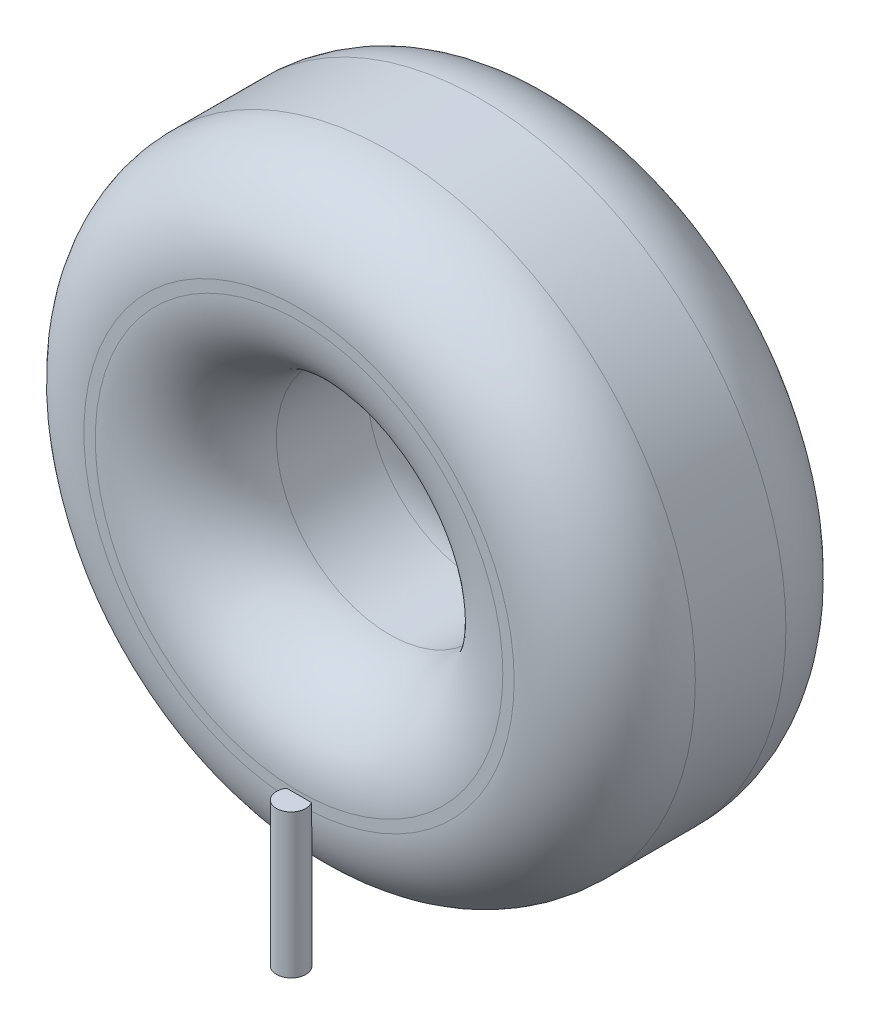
ISO-10303-21;
HEADER;
FILE_DESCRIPTION(('STEP AP214'),'2;1');
FILE_NAME('part.step','',(''),(''),'','','');
FILE_SCHEMA(('AUTOMOTIVE_DESIGN { 1 0 10303 214 1 1 1 1 }'));
ENDSEC;
DATA;
#1=APPLICATION_CONTEXT('core data for automotive mechanical design processes');
#2=APPLICATION_PROTOCOL_DEFINITION('international standard','automotive_design',2000,#1);
#3=PRODUCT_CONTEXT('',#1,'mechanical');
#4=PRODUCT('Part','Part','',(#3));
#5=PRODUCT_RELATED_PRODUCT_CATEGORY('part','',(#4));
#6=PRODUCT_DEFINITION_FORMATION('','',#4);
#7=PRODUCT_DEFINITION_CONTEXT('part definition',#1,'design');
#8=PRODUCT_DEFINITION('design','',#6,#7);
#9=PRODUCT_DEFINITION_SHAPE('','',#8);
#10=(LENGTH_UNIT() NAMED_UNIT(*) SI_UNIT(.MILLI.,.METRE.));
#11=(NAMED_UNIT(*) PLANE_ANGLE_UNIT() SI_UNIT($,.RADIAN.));
#12=(NAMED_UNIT(*) SI_UNIT($,.STERADIAN.) SOLID_ANGLE_UNIT());
#13=UNCERTAINTY_MEASURE_WITH_UNIT(LENGTH_MEASURE(1.E-05),#10,'distance_accuracy_value','');
#14=(GEOMETRIC_REPRESENTATION_CONTEXT(3) GLOBAL_UNCERTAINTY_ASSIGNED_CONTEXT((#13)) GLOBAL_UNIT_ASSIGNED_CONTEXT((#10,
#11,#12)) REPRESENTATION_CONTEXT('',''));
#15=CARTESIAN_POINT('',(0.,0.,0.));
#16=DIRECTION('',(0.,0.,1.));
#17=DIRECTION('',(1.,0.,0.));
#18=AXIS2_PLACEMENT_3D('',#15,#16,#17);
#19=CARTESIAN_POINT('',(0.,0.,6.));
#20=DIRECTION('',(0.,0.,1.));
#21=DIRECTION('',(1.,0.,0.));
#22=AXIS2_PLACEMENT_3D('',#19,#20,#21);
#23=PLANE('',#22);
#24=DIRECTION('',(0.,1.,0.));
#25=VECTOR('',#24,1.);
#26=CARTESIAN_POINT('',(0.547722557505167,-15.494,6.));
#27=LINE('',#26,#25);
#28=CARTESIAN_POINT('',(0.547722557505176,-9.4841973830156,6.));
#29=VERTEX_POINT('',#28);
#30=CARTESIAN_POINT('',(0.547722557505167,-9.144,6.));
#31=VERTEX_POINT('',#30);
#32=EDGE_CURVE('E77',#29,#31,#27,.T.);
#33=ORIENTED_EDGE('',*,*,#32,.F.);
#34=CARTESIAN_POINT('',(0.,0.,6.));
#35=DIRECTION('',(0.,0.,1.));
#36=DIRECTION('',(1.,0.,0.));
#37=AXIS2_PLACEMENT_3D('',#34,#35,#36);
#38=CIRCLE('',#37,9.5);
#39=CARTESIAN_POINT('',(-0.547722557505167,-9.4841973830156,6.));
#40=VERTEX_POINT('',#39);
#41=EDGE_CURVE('E136',#29,#40,#38,.T.);
#42=ORIENTED_EDGE('',*,*,#41,.T.);
#43=DIRECTION('',(0.,1.,0.));
#44=VECTOR('',#43,1.);
#45=CARTESIAN_POINT('',(-0.547722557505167,-15.494,6.));
#46=LINE('',#45,#44);
#47=CARTESIAN_POINT('',(-0.547722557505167,-9.144,6.));
#48=VERTEX_POINT('',#47);
#49=EDGE_CURVE('E149',#48,#40,#46,.F.);
#50=ORIENTED_EDGE('',*,*,#49,.F.);
#51=DIRECTION('',(-1.,0.,0.));
#52=VECTOR('',#51,1.);
#53=CARTESIAN_POINT('',(0.,-9.144,6.));
#54=LINE('',#53,#52);
#55=EDGE_CURVE('E88',#31,#48,#54,.T.);
#56=ORIENTED_EDGE('',*,*,#55,.F.);
#57=EDGE_LOOP('',(#33,#42,#50,#56));
#58=FACE_BOUND('',#57,.T.);
#59=CARTESIAN_POINT('',(0.,0.,6.));
#60=DIRECTION('',(0.,0.,1.));
#61=DIRECTION('',(1.,0.,0.));
#62=AXIS2_PLACEMENT_3D('',#59,#60,#61);
#63=CIRCLE('',#62,9.);
#64=CARTESIAN_POINT('',(9.,0.,6.));
#65=VERTEX_POINT('',#64);
#66=EDGE_CURVE('E133',#65,#65,#63,.F.);
#67=ORIENTED_EDGE('',*,*,#66,.T.);
#68=EDGE_LOOP('',(#67));
#69=FACE_BOUND('',#68,.T.);
#70=ADVANCED_FACE('F34',(#58,#69),#23,.T.);
#71=CARTESIAN_POINT('',(0.,0.,-6.));
#72=DIRECTION('',(0.,0.,1.));
#73=DIRECTION('',(1.,0.,0.));
#74=AXIS2_PLACEMENT_3D('',#71,#72,#73);
#75=PLANE('',#74);
#76=CARTESIAN_POINT('',(0.,0.,-6.));
#77=DIRECTION('',(0.,0.,1.));
#78=DIRECTION('',(1.,0.,0.));
#79=AXIS2_PLACEMENT_3D('',#76,#77,#78);
#80=CIRCLE('',#79,9.5);
#81=CARTESIAN_POINT('',(-0.547722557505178,-9.4841973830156,-6.));
#82=VERTEX_POINT('',#81);
#83=CARTESIAN_POINT('',(0.547722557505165,-9.4841973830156,-6.));
#84=VERTEX_POINT('',#83);
#85=EDGE_CURVE('E72',#82,#84,#80,.F.);
#86=ORIENTED_EDGE('',*,*,#85,.T.);
#87=DIRECTION('',(0.,1.,0.));
#88=VECTOR('',#87,1.);
#89=CARTESIAN_POINT('',(0.547722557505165,-15.494,-6.));
#90=LINE('',#89,#88);
#91=CARTESIAN_POINT('',(0.547722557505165,-9.144,-6.));
#92=VERTEX_POINT('',#91);
#93=EDGE_CURVE('E50',#84,#92,#90,.T.);
#94=ORIENTED_EDGE('',*,*,#93,.T.);
#95=DIRECTION('',(1.,0.,0.));
#96=VECTOR('',#95,1.);
#97=CARTESIAN_POINT('',(0.,-9.144,-6.));
#98=LINE('',#97,#96);
#99=CARTESIAN_POINT('',(-0.547722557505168,-9.144,-6.));
#100=VERTEX_POINT('',#99);
#101=EDGE_CURVE('E11',#100,#92,#98,.T.);
#102=ORIENTED_EDGE('',*,*,#101,.F.);
#103=DIRECTION('',(0.,1.,0.));
#104=VECTOR('',#103,1.);
#105=CARTESIAN_POINT('',(-0.547722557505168,-15.494,-6.));
#106=LINE('',#105,#104);
#107=EDGE_CURVE('E79',#100,#82,#106,.F.);
#108=ORIENTED_EDGE('',*,*,#107,.T.);
#109=EDGE_LOOP('',(#86,#94,#102,#108));
#110=FACE_BOUND('',#109,.T.);
#111=CARTESIAN_POINT('',(0.,0.,-6.));
#112=DIRECTION('',(0.,0.,1.));
#113=DIRECTION('',(1.,0.,0.));
#114=AXIS2_PLACEMENT_3D('',#111,#112,#113);
#115=CIRCLE('',#114,9.);
#116=CARTESIAN_POINT('',(9.,0.,-6.));
#117=VERTEX_POINT('',#116);
#118=EDGE_CURVE('E76',#117,#117,#115,.T.);
#119=ORIENTED_EDGE('',*,*,#118,.T.);
#120=EDGE_LOOP('',(#119));
#121=FACE_BOUND('',#120,.T.);
#122=ADVANCED_FACE('F80',(#110,#121),#75,.F.);
#123=CARTESIAN_POINT('',(0.,0.,6.));
#124=DIRECTION('',(0.,0.,-1.));
#125=DIRECTION('',(-1.,0.,0.));
#126=AXIS2_PLACEMENT_3D('',#123,#124,#125);
#127=CYLINDRICAL_SURFACE('',#126,13.5);
#128=CARTESIAN_POINT('',(0.,0.,-2.));
#129=DIRECTION('',(0.,0.,1.));
#130=DIRECTION('',(1.,0.,0.));
#131=AXIS2_PLACEMENT_3D('',#128,#129,#130);
#132=CIRCLE('',#131,13.5);
#133=CARTESIAN_POINT('',(13.5,0.,-2.));
#134=VERTEX_POINT('',#133);
#135=EDGE_CURVE('E127',#134,#134,#132,.T.);
#136=ORIENTED_EDGE('',*,*,#135,.T.);
#137=EDGE_LOOP('',(#136));
#138=FACE_BOUND('',#137,.T.);
#139=CARTESIAN_POINT('',(0.,0.,2.));
#140=DIRECTION('',(0.,0.,1.));
#141=DIRECTION('',(1.,0.,0.));
#142=AXIS2_PLACEMENT_3D('',#139,#140,#141);
#143=CIRCLE('',#142,13.5);
#144=CARTESIAN_POINT('',(13.5,0.,2.));
#145=VERTEX_POINT('',#144);
#146=EDGE_CURVE('E130',#145,#145,#143,.F.);
#147=ORIENTED_EDGE('',*,*,#146,.T.);
#148=EDGE_LOOP('',(#147));
#149=FACE_BOUND('',#148,.T.);
#150=ADVANCED_FACE('F172',(#138,#149),#127,.T.);
#151=CARTESIAN_POINT('',(0.,0.,6.));
#152=DIRECTION('',(0.,0.,-1.));
#153=DIRECTION('',(-1.,0.,0.));
#154=AXIS2_PLACEMENT_3D('',#151,#152,#153);
#155=CYLINDRICAL_SURFACE('',#154,5.);
#156=CARTESIAN_POINT('',(0.,0.,-2.));
#157=DIRECTION('',(0.,0.,1.));
#158=DIRECTION('',(1.,0.,0.));
#159=AXIS2_PLACEMENT_3D('',#156,#157,#158);
#160=CIRCLE('',#159,5.);
#161=CARTESIAN_POINT('',(5.,0.,-2.));
#162=VERTEX_POINT('',#161);
#163=EDGE_CURVE('E139',#162,#162,#160,.F.);
#164=ORIENTED_EDGE('',*,*,#163,.T.);
#165=EDGE_LOOP('',(#164));
#166=FACE_BOUND('',#165,.T.);
#167=CARTESIAN_POINT('',(0.,0.,2.));
#168=DIRECTION('',(0.,0.,1.));
#169=DIRECTION('',(1.,0.,0.));
#170=AXIS2_PLACEMENT_3D('',#167,#168,#169);
#171=CIRCLE('',#170,5.);
#172=CARTESIAN_POINT('',(5.,0.,2.));
#173=VERTEX_POINT('',#172);
#174=EDGE_CURVE('E142',#173,#173,#171,.T.);
#175=ORIENTED_EDGE('',*,*,#174,.T.);
#176=EDGE_LOOP('',(#175));
#177=FACE_BOUND('',#176,.T.);
#178=ADVANCED_FACE('F120',(#166,#177),#155,.F.);
#179=CARTESIAN_POINT('',(0.,0.,-2.));
#180=DIRECTION('',(0.,0.,1.));
#181=DIRECTION('',(1.,0.,0.));
#182=AXIS2_PLACEMENT_3D('',#179,#180,#181);
#183=TOROIDAL_SURFACE('',#182,9.,4.);
#184=ORIENTED_EDGE('',*,*,#163,.F.);
#185=EDGE_LOOP('',(#184));
#186=FACE_BOUND('',#185,.T.);
#187=ORIENTED_EDGE('',*,*,#118,.F.);
#188=EDGE_LOOP('',(#187));
#189=FACE_BOUND('',#188,.T.);
#190=ADVANCED_FACE('F180',(#186,#189),#183,.T.);
#191=CARTESIAN_POINT('',(0.,0.,2.));
#192=DIRECTION('',(0.,0.,1.));
#193=DIRECTION('',(1.,0.,0.));
#194=AXIS2_PLACEMENT_3D('',#191,#192,#193);
#195=TOROIDAL_SURFACE('',#194,9.,4.);
#196=ORIENTED_EDGE('',*,*,#66,.F.);
#197=EDGE_LOOP('',(#196));
#198=FACE_BOUND('',#197,.T.);
#199=ORIENTED_EDGE('',*,*,#174,.F.);
#200=EDGE_LOOP('',(#199));
#201=FACE_BOUND('',#200,.T.);
#202=ADVANCED_FACE('F182',(#198,#201),#195,.T.);
#203=CARTESIAN_POINT('',(0.,0.,-2.));
#204=DIRECTION('',(0.,0.,1.));
#205=DIRECTION('',(1.,0.,0.));
#206=AXIS2_PLACEMENT_3D('',#203,#204,#205);
#207=TOROIDAL_SURFACE('',#206,9.5,4.);
#208=CARTESIAN_POINT('',(0.53817628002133,-9.1438,-5.98549171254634));
#209=CARTESIAN_POINT('',(0.540795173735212,-9.18917788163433,-5.98937431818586));
#210=CARTESIAN_POINT('',(0.54284661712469,-9.23465231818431,-5.99247760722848));
#211=CARTESIAN_POINT('',(0.545884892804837,-9.32571568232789,-5.99712552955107));
#212=CARTESIAN_POINT('',(0.546871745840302,-9.37130460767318,-5.99867019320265));
#213=CARTESIAN_POINT('',(0.547852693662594,-9.46265669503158,-6.00020328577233));
#214=CARTESIAN_POINT('',(0.547843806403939,-9.50841996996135,-6.00018704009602));
#215=CARTESIAN_POINT('',(0.546821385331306,-9.59990321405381,-5.9985939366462));
#216=CARTESIAN_POINT('',(0.545807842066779,-9.64562318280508,-5.99701706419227));
#217=CARTESIAN_POINT('',(0.541056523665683,-9.78720333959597,-5.98971873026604));
#218=CARTESIAN_POINT('',(0.535548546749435,-9.88290333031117,-5.98134632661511));
#219=CARTESIAN_POINT('',(0.522879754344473,-10.0253431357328,-5.96380846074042));
#220=CARTESIAN_POINT('',(0.517926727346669,-10.0726094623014,-5.95713822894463));
#221=CARTESIAN_POINT('',(0.506241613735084,-10.1666629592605,-5.94218754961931));
#222=CARTESIAN_POINT('',(0.499509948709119,-10.2134502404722,-5.93390748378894));
#223=CARTESIAN_POINT('',(0.484030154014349,-10.3053516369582,-5.91600491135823));
#224=CARTESIAN_POINT('',(0.475329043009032,-10.3504800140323,-5.90641550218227));
#225=CARTESIAN_POINT('',(0.455285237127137,-10.4398857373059,-5.88586368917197));
#226=CARTESIAN_POINT('',(0.443940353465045,-10.4841623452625,-5.87490015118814));
#227=CARTESIAN_POINT('',(0.418008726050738,-10.5708743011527,-5.85193808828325));
#228=CARTESIAN_POINT('',(0.403463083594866,-10.6133254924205,-5.83995377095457));
#229=CARTESIAN_POINT('',(0.370009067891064,-10.6961935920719,-5.81518221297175));
#230=CARTESIAN_POINT('',(0.351110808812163,-10.7366149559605,-5.80239688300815));
#231=CARTESIAN_POINT('',(0.3143772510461,-10.8016203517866,-5.78082440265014));
#232=CARTESIAN_POINT('',(0.298153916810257,-10.8271177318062,-5.77207348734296));
#233=CARTESIAN_POINT('',(0.262247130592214,-10.8757054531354,-5.75491728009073));
#234=CARTESIAN_POINT('',(0.242571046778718,-10.8988007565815,-5.74651129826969));
#235=CARTESIAN_POINT('',(0.207387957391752,-10.9329138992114,-5.73380898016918));
#236=CARTESIAN_POINT('',(0.193198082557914,-10.9451552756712,-5.72917764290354));
#237=CARTESIAN_POINT('',(0.163071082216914,-10.9675807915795,-5.72059346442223));
#238=CARTESIAN_POINT('',(0.147135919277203,-10.9777672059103,-5.71663987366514));
#239=CARTESIAN_POINT('',(0.11702543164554,-10.9935121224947,-5.71047700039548));
#240=CARTESIAN_POINT('',(0.103165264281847,-10.9995918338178,-5.7080761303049));
#241=CARTESIAN_POINT('',(0.0745559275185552,-11.0095432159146,-5.70412917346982));
#242=CARTESIAN_POINT('',(0.059807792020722,-11.013417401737,-5.70258211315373));
#243=CARTESIAN_POINT('',(0.0296770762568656,-11.018620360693,-5.70050136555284));
#244=CARTESIAN_POINT('',(0.0142906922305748,-11.0199306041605,-5.69997505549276));
#245=CARTESIAN_POINT('',(-0.0164693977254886,-11.0198016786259,-5.70002677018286));
#246=CARTESIAN_POINT('',(-0.0318431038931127,-11.0183625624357,-5.7006047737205));
#247=CARTESIAN_POINT('',(-0.0604167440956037,-11.0131913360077,-5.70267222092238));
#248=CARTESIAN_POINT('',(-0.0736734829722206,-11.0097205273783,-5.70405773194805));
#249=CARTESIAN_POINT('',(-0.0994772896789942,-11.0009834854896,-5.70752509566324));
#250=CARTESIAN_POINT('',(-0.112024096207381,-10.9957165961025,-5.7096072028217));
#251=CARTESIAN_POINT('',(-0.14253496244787,-10.9805854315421,-5.71554354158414));
#252=CARTESIAN_POINT('',(-0.159946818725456,-10.9697520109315,-5.71975747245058));
#253=CARTESIAN_POINT('',(-0.192739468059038,-10.9456355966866,-5.72899819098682));
#254=CARTESIAN_POINT('',(-0.208114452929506,-10.9323458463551,-5.73402721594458));
#255=CARTESIAN_POINT('',(-0.246898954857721,-10.8943496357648,-5.74815638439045));
#256=CARTESIAN_POINT('',(-0.268588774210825,-10.8680633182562,-5.75768354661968));
#257=CARTESIAN_POINT('',(-0.307772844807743,-10.8126855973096,-5.77706657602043));
#258=CARTESIAN_POINT('',(-0.325256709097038,-10.7835874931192,-5.78692318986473));
#259=CARTESIAN_POINT('',(-0.357364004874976,-10.7228442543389,-5.80671830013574));
#260=CARTESIAN_POINT('',(-0.371900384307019,-10.6911523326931,-5.81665216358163));
#261=CARTESIAN_POINT('',(-0.398267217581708,-10.6265093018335,-5.83604565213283));
#262=CARTESIAN_POINT('',(-0.410094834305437,-10.5935569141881,-5.84550477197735));
#263=CARTESIAN_POINT('',(-0.442396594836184,-10.4932482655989,-5.87292989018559));
#264=CARTESIAN_POINT('',(-0.459624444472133,-10.4245775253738,-5.88989839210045));
#265=CARTESIAN_POINT('',(-0.489340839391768,-10.2801845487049,-5.92158268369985));
#266=CARTESIAN_POINT('',(-0.501378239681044,-10.2043191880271,-5.93603486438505));
#267=CARTESIAN_POINT('',(-0.520747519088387,-10.0512414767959,-5.96068502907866));
#268=CARTESIAN_POINT('',(-0.528074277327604,-9.97402775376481,-5.97087837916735));
#269=CARTESIAN_POINT('',(-0.539151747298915,-9.81893741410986,-5.98680860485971));
#270=CARTESIAN_POINT('',(-0.542904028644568,-9.74106110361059,-5.99254743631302));
#271=CARTESIAN_POINT('',(-0.547411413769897,-9.58507106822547,-5.9994891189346));
#272=CARTESIAN_POINT('',(-0.548168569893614,-9.50695754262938,-6.00069507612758));
#273=CARTESIAN_POINT('',(-0.547057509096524,-9.3812237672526,-5.99896149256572));
#274=CARTESIAN_POINT('',(-0.546096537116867,-9.333570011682,-5.99745292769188));
#275=CARTESIAN_POINT('',(-0.543019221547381,-9.23851046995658,-5.99273943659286));
#276=CARTESIAN_POINT('',(-0.540905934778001,-9.19110436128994,-5.98953899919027));
#277=CARTESIAN_POINT('',(-0.538176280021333,-9.1438,-5.98549171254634));
#278=B_SPLINE_CURVE_WITH_KNOTS('',3,(#208,#209,#210,#211,#212,#213,#214,#215,#216,#217,#218,
#219,#220,#221,#222,#223,#224,#225,#226,#227,#228,#229,#230,#231,#232,#233,#234,#235,#236,#237,
#238,#239,#240,#241,#242,#243,#244,#245,#246,#247,#248,#249,#250,#251,#252,#253,#254,#255,#256,
#257,#258,#259,#260,#261,#262,#263,#264,#265,#266,#267,#268,#269,#270,#271,#272,#273,#274,#275,
#276,#277),.UNSPECIFIED.,.F.,.F.,(4,2,2,2,2,2,2,2,2,2,2,2,2,2,2,2,2,2,2,2,2,2,2,2,2,2,2,2,2,2,2,
2,2,2,4),(0.,0.136841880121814,0.273681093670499,0.410930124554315,0.548180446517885,
0.836387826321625,0.980315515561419,1.12420912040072,1.26497453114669,1.40585689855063,
1.54502602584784,1.68387497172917,1.7780797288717,1.87208584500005,1.92985052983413,
1.98755091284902,2.03334751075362,2.07909177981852,2.12516544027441,2.17123821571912,
2.21239050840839,2.2535578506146,2.31600489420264,2.37862634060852,2.48418681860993,
2.59000537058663,2.69859936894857,2.80730659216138,3.02519170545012,3.2593822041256,
3.4938268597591,3.72816851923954,3.96234957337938,4.10537111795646,4.24801509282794),.UNSPECIFIED.);
#279=EDGE_CURVE('E43',#84,#82,#278,.T.);
#280=ORIENTED_EDGE('',*,*,#279,.F.);
#281=ORIENTED_EDGE('',*,*,#85,.F.);
#282=EDGE_LOOP('',(#280,#281));
#283=FACE_BOUND('',#282,.T.);
#284=ORIENTED_EDGE('',*,*,#135,.F.);
#285=EDGE_LOOP('',(#284));
#286=FACE_BOUND('',#285,.T.);
#287=ADVANCED_FACE('F73',(#283,#286),#207,.T.);
#288=CARTESIAN_POINT('',(0.,0.,2.));
#289=DIRECTION('',(0.,0.,1.));
#290=DIRECTION('',(1.,0.,0.));
#291=AXIS2_PLACEMENT_3D('',#288,#289,#290);
#292=TOROIDAL_SURFACE('',#291,9.5,4.);
#293=CARTESIAN_POINT('',(-0.538176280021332,-9.1438,5.98549171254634));
#294=CARTESIAN_POINT('',(-0.540795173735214,-9.18917788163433,5.98937431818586));
#295=CARTESIAN_POINT('',(-0.542846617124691,-9.23465231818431,5.99247760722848));
#296=CARTESIAN_POINT('',(-0.545884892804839,-9.32571568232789,5.99712552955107));
#297=CARTESIAN_POINT('',(-0.546871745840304,-9.37130460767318,5.99867019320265));
#298=CARTESIAN_POINT('',(-0.547852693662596,-9.46265669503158,6.00020328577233));
#299=CARTESIAN_POINT('',(-0.547843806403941,-9.50841996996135,6.00018704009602));
#300=CARTESIAN_POINT('',(-0.546821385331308,-9.59990321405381,5.9985939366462));
#301=CARTESIAN_POINT('',(-0.545807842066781,-9.64562318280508,5.99701706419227));
#302=CARTESIAN_POINT('',(-0.541056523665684,-9.78720333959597,5.98971873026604));
#303=CARTESIAN_POINT('',(-0.535548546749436,-9.88290333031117,5.98134632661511));
#304=CARTESIAN_POINT('',(-0.522879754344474,-10.0253431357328,5.96380846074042));
#305=CARTESIAN_POINT('',(-0.51792672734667,-10.0726094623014,5.95713822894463));
#306=CARTESIAN_POINT('',(-0.506241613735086,-10.1666629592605,5.94218754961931));
#307=CARTESIAN_POINT('',(-0.49950994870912,-10.2134502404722,5.93390748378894));
#308=CARTESIAN_POINT('',(-0.484030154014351,-10.3053516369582,5.91600491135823));
#309=CARTESIAN_POINT('',(-0.475329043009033,-10.3504800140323,5.90641550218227));
#310=CARTESIAN_POINT('',(-0.455285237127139,-10.4398857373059,5.88586368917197));
#311=CARTESIAN_POINT('',(-0.443940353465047,-10.4841623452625,5.87490015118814));
#312=CARTESIAN_POINT('',(-0.41800872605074,-10.5708743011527,5.85193808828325));
#313=CARTESIAN_POINT('',(-0.403463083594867,-10.6133254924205,5.83995377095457));
#314=CARTESIAN_POINT('',(-0.370009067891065,-10.6961935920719,5.81518221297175));
#315=CARTESIAN_POINT('',(-0.351110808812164,-10.7366149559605,5.80239688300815));
#316=CARTESIAN_POINT('',(-0.314377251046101,-10.8016203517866,5.78082440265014));
#317=CARTESIAN_POINT('',(-0.298153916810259,-10.8271177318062,5.77207348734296));
#318=CARTESIAN_POINT('',(-0.262247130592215,-10.8757054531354,5.75491728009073));
#319=CARTESIAN_POINT('',(-0.24257104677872,-10.8988007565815,5.74651129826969));
#320=CARTESIAN_POINT('',(-0.207387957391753,-10.9329138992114,5.73380898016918));
#321=CARTESIAN_POINT('',(-0.193198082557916,-10.9451552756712,5.72917764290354));
#322=CARTESIAN_POINT('',(-0.163071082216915,-10.9675807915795,5.72059346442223));
#323=CARTESIAN_POINT('',(-0.147135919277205,-10.9777672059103,5.71663987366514));
#324=CARTESIAN_POINT('',(-0.117025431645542,-10.9935121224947,5.71047700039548));
#325=CARTESIAN_POINT('',(-0.103165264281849,-10.9995918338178,5.7080761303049));
#326=CARTESIAN_POINT('',(-0.0745559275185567,-11.0095432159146,5.70412917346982));
#327=CARTESIAN_POINT('',(-0.0598077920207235,-11.013417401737,5.70258211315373));
#328=CARTESIAN_POINT('',(-0.0296770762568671,-11.018620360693,5.70050136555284));
#329=CARTESIAN_POINT('',(-0.0142906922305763,-11.0199306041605,5.69997505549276));
#330=CARTESIAN_POINT('',(0.0164693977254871,-11.0198016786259,5.70002677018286));
#331=CARTESIAN_POINT('',(0.0318431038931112,-11.0183625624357,5.7006047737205));
#332=CARTESIAN_POINT('',(0.0604167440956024,-11.0131913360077,5.70267222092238));
#333=CARTESIAN_POINT('',(0.0736734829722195,-11.0097205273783,5.70405773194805));
#334=CARTESIAN_POINT('',(0.0994772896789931,-11.0009834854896,5.70752509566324));
#335=CARTESIAN_POINT('',(0.112024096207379,-10.9957165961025,5.7096072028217));
#336=CARTESIAN_POINT('',(0.142534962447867,-10.9805854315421,5.71554354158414));
#337=CARTESIAN_POINT('',(0.159946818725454,-10.9697520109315,5.71975747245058));
#338=CARTESIAN_POINT('',(0.192739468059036,-10.9456355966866,5.72899819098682));
#339=CARTESIAN_POINT('',(0.208114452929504,-10.9323458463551,5.73402721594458));
#340=CARTESIAN_POINT('',(0.24689895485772,-10.8943496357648,5.74815638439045));
#341=CARTESIAN_POINT('',(0.268588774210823,-10.8680633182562,5.75768354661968));
#342=CARTESIAN_POINT('',(0.307772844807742,-10.8126855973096,5.77706657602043));
#343=CARTESIAN_POINT('',(0.325256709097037,-10.7835874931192,5.78692318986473));
#344=CARTESIAN_POINT('',(0.357364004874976,-10.7228442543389,5.80671830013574));
#345=CARTESIAN_POINT('',(0.371900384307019,-10.6911523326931,5.81665216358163));
#346=CARTESIAN_POINT('',(0.398267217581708,-10.6265093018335,5.83604565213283));
#347=CARTESIAN_POINT('',(0.410094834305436,-10.5935569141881,5.84550477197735));
#348=CARTESIAN_POINT('',(0.442396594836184,-10.4932482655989,5.8729298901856));
#349=CARTESIAN_POINT('',(0.459624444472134,-10.4245775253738,5.88989839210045));
#350=CARTESIAN_POINT('',(0.489340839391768,-10.2801845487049,5.92158268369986));
#351=CARTESIAN_POINT('',(0.501378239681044,-10.2043191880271,5.93603486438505));
#352=CARTESIAN_POINT('',(0.520747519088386,-10.0512414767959,5.96068502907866));
#353=CARTESIAN_POINT('',(0.528074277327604,-9.9740277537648,5.97087837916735));
#354=CARTESIAN_POINT('',(0.539151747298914,-9.81893741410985,5.98680860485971));
#355=CARTESIAN_POINT('',(0.542904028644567,-9.74106110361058,5.99254743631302));
#356=CARTESIAN_POINT('',(0.547411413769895,-9.58507106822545,5.9994891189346));
#357=CARTESIAN_POINT('',(0.548168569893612,-9.50695754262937,6.00069507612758));
#358=CARTESIAN_POINT('',(0.547057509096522,-9.38122376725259,5.99896149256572));
#359=CARTESIAN_POINT('',(0.546096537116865,-9.33357001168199,5.99745292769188));
#360=CARTESIAN_POINT('',(0.543019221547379,-9.23851046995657,5.99273943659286));
#361=CARTESIAN_POINT('',(0.540905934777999,-9.19110436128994,5.98953899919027));
#362=CARTESIAN_POINT('',(0.538176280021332,-9.1438,5.98549171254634));
#363=B_SPLINE_CURVE_WITH_KNOTS('',3,(#293,#294,#295,#296,#297,#298,#299,#300,#301,#302,#303,
#304,#305,#306,#307,#308,#309,#310,#311,#312,#313,#314,#315,#316,#317,#318,#319,#320,#321,#322,
#323,#324,#325,#326,#327,#328,#329,#330,#331,#332,#333,#334,#335,#336,#337,#338,#339,#340,#341,
#342,#343,#344,#345,#346,#347,#348,#349,#350,#351,#352,#353,#354,#355,#356,#357,#358,#359,#360,
#361,#362),.UNSPECIFIED.,.F.,.F.,(4,2,2,2,2,2,2,2,2,2,2,2,2,2,2,2,2,2,2,2,2,2,2,2,2,2,2,2,2,2,2,
2,2,2,4),(0.,0.136841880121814,0.273681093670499,0.410930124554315,0.548180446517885,
0.836387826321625,0.980315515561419,1.12420912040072,1.26497453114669,1.40585689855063,
1.54502602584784,1.68387497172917,1.7780797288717,1.87208584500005,1.92985052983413,
1.98755091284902,2.03334751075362,2.07909177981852,2.12516544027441,2.17123821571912,
2.21239050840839,2.2535578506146,2.31600489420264,2.37862634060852,2.48418681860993,
2.59000537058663,2.69859936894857,2.80730659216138,3.02519170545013,3.25938220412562,
3.49382685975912,3.72816851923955,3.9623495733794,4.10537111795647,4.24801509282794),.UNSPECIFIED.);
#364=EDGE_CURVE('E90',#40,#29,#363,.T.);
#365=ORIENTED_EDGE('',*,*,#364,.F.);
#366=ORIENTED_EDGE('',*,*,#41,.F.);
#367=EDGE_LOOP('',(#365,#366));
#368=FACE_BOUND('',#367,.T.);
#369=ORIENTED_EDGE('',*,*,#146,.F.);
#370=EDGE_LOOP('',(#369));
#371=FACE_BOUND('',#370,.T.);
#372=ADVANCED_FACE('F36',(#368,#371),#292,.T.);
#373=CARTESIAN_POINT('',(0.,-15.494,6.35));
#374=DIRECTION('',(0.,1.,0.));
#375=DIRECTION('',(0.,0.,1.));
#376=AXIS2_PLACEMENT_3D('',#373,#374,#375);
#377=CYLINDRICAL_SURFACE('',#376,0.65);
#378=CARTESIAN_POINT('',(0.,-15.494,6.35));
#379=DIRECTION('',(0.,1.,0.));
#380=DIRECTION('',(0.,0.,1.));
#381=AXIS2_PLACEMENT_3D('',#378,#379,#380);
#382=CIRCLE('',#381,0.65);
#383=CARTESIAN_POINT('',(0.,-15.494,7.));
#384=VERTEX_POINT('',#383);
#385=EDGE_CURVE('E152',#384,#384,#382,.T.);
#386=ORIENTED_EDGE('',*,*,#385,.T.);
#387=EDGE_LOOP('',(#386));
#388=FACE_BOUND('',#387,.T.);
#389=ORIENTED_EDGE('',*,*,#364,.T.);
#390=ORIENTED_EDGE('',*,*,#32,.T.);
#391=CARTESIAN_POINT('',(0.,-9.144,6.35));
#392=DIRECTION('',(0.,1.,0.));
#393=DIRECTION('',(0.,0.,1.));
#394=AXIS2_PLACEMENT_3D('',#391,#392,#393);
#395=CIRCLE('',#394,0.65);
#396=EDGE_CURVE('E153',#48,#31,#395,.T.);
#397=ORIENTED_EDGE('',*,*,#396,.F.);
#398=ORIENTED_EDGE('',*,*,#49,.T.);
#399=EDGE_LOOP('',(#389,#390,#397,#398));
#400=FACE_BOUND('',#399,.T.);
#401=ADVANCED_FACE('F111',(#388,#400),#377,.T.);
#402=CARTESIAN_POINT('',(0.,-15.494,6.35));
#403=DIRECTION('',(0.,1.,0.));
#404=DIRECTION('',(0.,0.,1.));
#405=AXIS2_PLACEMENT_3D('',#402,#403,#404);
#406=PLANE('',#405);
#407=ORIENTED_EDGE('',*,*,#385,.F.);
#408=EDGE_LOOP('',(#407));
#409=FACE_BOUND('',#408,.T.);
#410=ADVANCED_FACE('F107',(#409),#406,.F.);
#411=CARTESIAN_POINT('',(0.,-9.144,6.35));
#412=DIRECTION('',(0.,1.,0.));
#413=DIRECTION('',(0.,0.,1.));
#414=AXIS2_PLACEMENT_3D('',#411,#412,#413);
#415=PLANE('',#414);
#416=ORIENTED_EDGE('',*,*,#396,.T.);
#417=ORIENTED_EDGE('',*,*,#55,.T.);
#418=EDGE_LOOP('',(#416,#417));
#419=FACE_BOUND('',#418,.T.);
#420=ADVANCED_FACE('F110',(#419),#415,.T.);
#421=CARTESIAN_POINT('',(0.,-9.144,-6.35));
#422=DIRECTION('',(0.,-1.,0.));
#423=DIRECTION('',(0.,0.,-1.));
#424=AXIS2_PLACEMENT_3D('',#421,#422,#423);
#425=PLANE('',#424);
#426=CARTESIAN_POINT('',(0.,-9.144,-6.35));
#427=DIRECTION('',(0.,1.,0.));
#428=DIRECTION('',(0.,0.,-1.));
#429=AXIS2_PLACEMENT_3D('',#426,#427,#428);
#430=CIRCLE('',#429,0.65);
#431=EDGE_CURVE('E159',#92,#100,#430,.T.);
#432=ORIENTED_EDGE('',*,*,#431,.T.);
#433=ORIENTED_EDGE('',*,*,#101,.T.);
#434=EDGE_LOOP('',(#432,#433));
#435=FACE_BOUND('',#434,.T.);
#436=ADVANCED_FACE('F104',(#435),#425,.F.);
#437=CARTESIAN_POINT('',(0.,-15.494,-6.35));
#438=DIRECTION('',(0.,1.,0.));
#439=DIRECTION('',(0.,0.,1.));
#440=AXIS2_PLACEMENT_3D('',#437,#438,#439);
#441=CYLINDRICAL_SURFACE('',#440,0.65);
#442=CARTESIAN_POINT('',(0.,-15.494,-6.35));
#443=DIRECTION('',(0.,1.,0.));
#444=DIRECTION('',(0.,0.,-1.));
#445=AXIS2_PLACEMENT_3D('',#442,#443,#444);
#446=CIRCLE('',#445,0.65);
#447=CARTESIAN_POINT('',(0.,-15.494,-7.));
#448=VERTEX_POINT('',#447);
#449=EDGE_CURVE('E85',#448,#448,#446,.T.);
#450=ORIENTED_EDGE('',*,*,#449,.T.);
#451=EDGE_LOOP('',(#450));
#452=FACE_BOUND('',#451,.T.);
#453=ORIENTED_EDGE('',*,*,#93,.F.);
#454=ORIENTED_EDGE('',*,*,#279,.T.);
#455=ORIENTED_EDGE('',*,*,#107,.F.);
#456=ORIENTED_EDGE('',*,*,#431,.F.);
#457=EDGE_LOOP('',(#453,#454,#455,#456));
#458=FACE_BOUND('',#457,.T.);
#459=ADVANCED_FACE('F87',(#452,#458),#441,.T.);
#460=CARTESIAN_POINT('',(0.,-15.494,-6.35));
#461=DIRECTION('',(0.,-1.,0.));
#462=DIRECTION('',(0.,0.,-1.));
#463=AXIS2_PLACEMENT_3D('',#460,#461,#462);
#464=PLANE('',#463);
#465=ORIENTED_EDGE('',*,*,#449,.F.);
#466=EDGE_LOOP('',(#465));
#467=FACE_BOUND('',#466,.T.);
#468=ADVANCED_FACE('F103',(#467),#464,.T.);
#469=CLOSED_SHELL('',(#70,#122,#150,#178,#190,#202,#287,#372,#401,#410,#420,#436,#459,#468));
#470=MANIFOLD_SOLID_BREP('B2',#469);
#471=ADVANCED_BREP_SHAPE_REPRESENTATION('',(#18,#470),#14);
#472=SHAPE_DEFINITION_REPRESENTATION(#9,#471);
ENDSEC;
END-ISO-10303-21;
